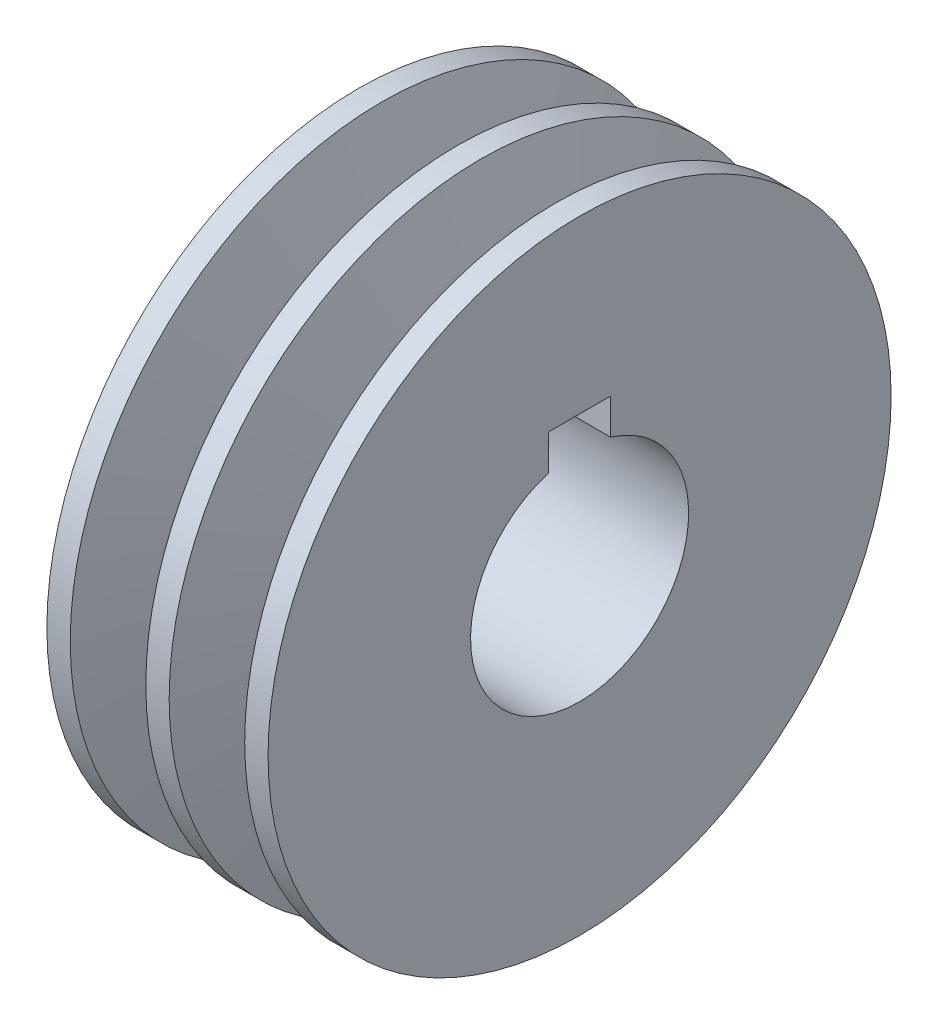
ISO-10303-21;
HEADER;
FILE_DESCRIPTION(('STEP AP214'),'2;1');
FILE_NAME('part.step','',(''),(''),'','','');
FILE_SCHEMA(('AUTOMOTIVE_DESIGN { 1 0 10303 214 1 1 1 1 }'));
ENDSEC;
DATA;
#1=APPLICATION_CONTEXT('core data for automotive mechanical design processes');
#2=APPLICATION_PROTOCOL_DEFINITION('international standard','automotive_design',2000,#1);
#3=PRODUCT_CONTEXT('',#1,'mechanical');
#4=PRODUCT('Part','Part','',(#3));
#5=PRODUCT_RELATED_PRODUCT_CATEGORY('part','',(#4));
#6=PRODUCT_DEFINITION_FORMATION('','',#4);
#7=PRODUCT_DEFINITION_CONTEXT('part definition',#1,'design');
#8=PRODUCT_DEFINITION('design','',#6,#7);
#9=PRODUCT_DEFINITION_SHAPE('','',#8);
#10=(LENGTH_UNIT() NAMED_UNIT(*) SI_UNIT(.MILLI.,.METRE.));
#11=(NAMED_UNIT(*) PLANE_ANGLE_UNIT() SI_UNIT($,.RADIAN.));
#12=(NAMED_UNIT(*) SI_UNIT($,.STERADIAN.) SOLID_ANGLE_UNIT());
#13=UNCERTAINTY_MEASURE_WITH_UNIT(LENGTH_MEASURE(1.E-05),#10,'distance_accuracy_value','');
#14=(GEOMETRIC_REPRESENTATION_CONTEXT(3) GLOBAL_UNCERTAINTY_ASSIGNED_CONTEXT((#13)) GLOBAL_UNIT_ASSIGNED_CONTEXT((#10,
#11,#12)) REPRESENTATION_CONTEXT('',''));
#15=CARTESIAN_POINT('',(0.,0.,0.));
#16=DIRECTION('',(0.,0.,1.));
#17=DIRECTION('',(1.,0.,0.));
#18=AXIS2_PLACEMENT_3D('',#15,#16,#17);
#19=CARTESIAN_POINT('',(0.,0.,0.));
#20=DIRECTION('',(1.,0.,0.));
#21=DIRECTION('',(0.,0.,-1.));
#22=AXIS2_PLACEMENT_3D('',#19,#20,#21);
#23=PLANE('',#22);
#24=DIRECTION('',(0.,1.,0.));
#25=VECTOR('',#24,1.);
#26=CARTESIAN_POINT('',(0.,0.,4.));
#27=LINE('',#26,#25);
#28=CARTESIAN_POINT('',(0.,13.4164078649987,4.));
#29=VERTEX_POINT('',#28);
#30=CARTESIAN_POINT('',(0.,18.,4.));
#31=VERTEX_POINT('',#30);
#32=EDGE_CURVE('E79',#29,#31,#27,.T.);
#33=ORIENTED_EDGE('',*,*,#32,.F.);
#34=CARTESIAN_POINT('',(0.,0.,0.));
#35=DIRECTION('',(1.,0.,0.));
#36=DIRECTION('',(0.,0.,-1.));
#37=AXIS2_PLACEMENT_3D('',#34,#35,#36);
#38=CIRCLE('',#37,14.);
#39=CARTESIAN_POINT('',(0.,13.4164078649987,-4.));
#40=VERTEX_POINT('',#39);
#41=EDGE_CURVE('E76',#29,#40,#38,.T.);
#42=ORIENTED_EDGE('',*,*,#41,.T.);
#43=DIRECTION('',(0.,1.,0.));
#44=VECTOR('',#43,1.);
#45=CARTESIAN_POINT('',(0.,0.,-4.));
#46=LINE('',#45,#44);
#47=CARTESIAN_POINT('',(0.,18.,-4.));
#48=VERTEX_POINT('',#47);
#49=EDGE_CURVE('E82',#40,#48,#46,.T.);
#50=ORIENTED_EDGE('',*,*,#49,.T.);
#51=DIRECTION('',(0.,0.,-1.));
#52=VECTOR('',#51,1.);
#53=CARTESIAN_POINT('',(0.,18.,0.));
#54=LINE('',#53,#52);
#55=EDGE_CURVE('E86',#31,#48,#54,.T.);
#56=ORIENTED_EDGE('',*,*,#55,.F.);
#57=EDGE_LOOP('',(#33,#42,#50,#56));
#58=FACE_BOUND('',#57,.T.);
#59=CARTESIAN_POINT('',(0.,0.,0.));
#60=DIRECTION('',(-1.,0.,0.));
#61=DIRECTION('',(0.,0.,1.));
#62=AXIS2_PLACEMENT_3D('',#59,#60,#61);
#63=CIRCLE('',#62,40.);
#64=CARTESIAN_POINT('',(0.,0.,40.));
#65=VERTEX_POINT('',#64);
#66=EDGE_CURVE('E11',#65,#65,#63,.T.);
#67=ORIENTED_EDGE('',*,*,#66,.T.);
#68=EDGE_LOOP('',(#67));
#69=FACE_BOUND('',#68,.T.);
#70=ADVANCED_FACE('F34',(#58,#69),#23,.F.);
#71=CARTESIAN_POINT('',(0.,0.,0.));
#72=DIRECTION('',(-1.,0.,0.));
#73=DIRECTION('',(0.,0.,1.));
#74=AXIS2_PLACEMENT_3D('',#71,#72,#73);
#75=CYLINDRICAL_SURFACE('',#74,40.);
#76=ORIENTED_EDGE('',*,*,#66,.F.);
#77=EDGE_LOOP('',(#76));
#78=FACE_BOUND('',#77,.T.);
#79=CARTESIAN_POINT('',(3.,0.,0.));
#80=DIRECTION('',(-1.,0.,0.));
#81=DIRECTION('',(0.,0.,1.));
#82=AXIS2_PLACEMENT_3D('',#79,#80,#81);
#83=CIRCLE('',#82,40.);
#84=CARTESIAN_POINT('',(3.,0.,40.));
#85=VERTEX_POINT('',#84);
#86=EDGE_CURVE('E41',#85,#85,#83,.T.);
#87=ORIENTED_EDGE('',*,*,#86,.T.);
#88=EDGE_LOOP('',(#87));
#89=FACE_BOUND('',#88,.T.);
#90=ADVANCED_FACE('F133',(#78,#89),#75,.T.);
#91=CARTESIAN_POINT('',(6.11660003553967,0.,0.));
#92=DIRECTION('',(-1.,0.,0.));
#93=DIRECTION('',(0.,0.,1.));
#94=AXIS2_PLACEMENT_3D('',#91,#92,#93);
#95=CONICAL_SURFACE('',#94,27.5,1.3264502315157);
#96=ORIENTED_EDGE('',*,*,#86,.F.);
#97=EDGE_LOOP('',(#96));
#98=FACE_BOUND('',#97,.T.);
#99=CARTESIAN_POINT('',(6.11660003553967,0.,0.));
#100=DIRECTION('',(-1.,0.,0.));
#101=DIRECTION('',(0.,0.,1.));
#102=AXIS2_PLACEMENT_3D('',#99,#100,#101);
#103=CIRCLE('',#102,27.5);
#104=CARTESIAN_POINT('',(6.11660003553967,0.,27.5));
#105=VERTEX_POINT('',#104);
#106=EDGE_CURVE('E128',#105,#105,#103,.T.);
#107=ORIENTED_EDGE('',*,*,#106,.T.);
#108=EDGE_LOOP('',(#107));
#109=FACE_BOUND('',#108,.T.);
#110=ADVANCED_FACE('F135',(#98,#109),#95,.T.);
#111=CARTESIAN_POINT('',(0.,0.,0.));
#112=DIRECTION('',(-1.,0.,0.));
#113=DIRECTION('',(0.,0.,1.));
#114=AXIS2_PLACEMENT_3D('',#111,#112,#113);
#115=CYLINDRICAL_SURFACE('',#114,27.5);
#116=ORIENTED_EDGE('',*,*,#106,.F.);
#117=EDGE_LOOP('',(#116));
#118=FACE_BOUND('',#117,.T.);
#119=CARTESIAN_POINT('',(9.58339996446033,0.,0.));
#120=DIRECTION('',(-1.,0.,0.));
#121=DIRECTION('',(0.,0.,1.));
#122=AXIS2_PLACEMENT_3D('',#119,#120,#121);
#123=CIRCLE('',#122,27.5);
#124=CARTESIAN_POINT('',(9.58339996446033,0.,27.5));
#125=VERTEX_POINT('',#124);
#126=EDGE_CURVE('E125',#125,#125,#123,.T.);
#127=ORIENTED_EDGE('',*,*,#126,.T.);
#128=EDGE_LOOP('',(#127));
#129=FACE_BOUND('',#128,.T.);
#130=ADVANCED_FACE('F138',(#118,#129),#115,.T.);
#131=CARTESIAN_POINT('',(12.7,0.,0.));
#132=DIRECTION('',(1.,0.,0.));
#133=DIRECTION('',(0.,0.,-1.));
#134=AXIS2_PLACEMENT_3D('',#131,#132,#133);
#135=CONICAL_SURFACE('',#134,40.,1.3264502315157);
#136=ORIENTED_EDGE('',*,*,#126,.F.);
#137=EDGE_LOOP('',(#136));
#138=FACE_BOUND('',#137,.T.);
#139=CARTESIAN_POINT('',(12.7,0.,0.));
#140=DIRECTION('',(-1.,0.,0.));
#141=DIRECTION('',(0.,0.,1.));
#142=AXIS2_PLACEMENT_3D('',#139,#140,#141);
#143=CIRCLE('',#142,40.);
#144=CARTESIAN_POINT('',(12.7,0.,40.));
#145=VERTEX_POINT('',#144);
#146=EDGE_CURVE('E122',#145,#145,#143,.T.);
#147=ORIENTED_EDGE('',*,*,#146,.T.);
#148=EDGE_LOOP('',(#147));
#149=FACE_BOUND('',#148,.T.);
#150=ADVANCED_FACE('F144',(#138,#149),#135,.T.);
#151=CARTESIAN_POINT('',(0.,0.,0.));
#152=DIRECTION('',(-1.,0.,0.));
#153=DIRECTION('',(0.,0.,1.));
#154=AXIS2_PLACEMENT_3D('',#151,#152,#153);
#155=CYLINDRICAL_SURFACE('',#154,40.);
#156=ORIENTED_EDGE('',*,*,#146,.F.);
#157=EDGE_LOOP('',(#156));
#158=FACE_BOUND('',#157,.T.);
#159=CARTESIAN_POINT('',(15.7,0.,0.));
#160=DIRECTION('',(-1.,0.,0.));
#161=DIRECTION('',(0.,0.,1.));
#162=AXIS2_PLACEMENT_3D('',#159,#160,#161);
#163=CIRCLE('',#162,40.);
#164=CARTESIAN_POINT('',(15.7,0.,40.));
#165=VERTEX_POINT('',#164);
#166=EDGE_CURVE('E119',#165,#165,#163,.T.);
#167=ORIENTED_EDGE('',*,*,#166,.T.);
#168=EDGE_LOOP('',(#167));
#169=FACE_BOUND('',#168,.T.);
#170=ADVANCED_FACE('F150',(#158,#169),#155,.T.);
#171=CARTESIAN_POINT('',(18.8166000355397,0.,0.));
#172=DIRECTION('',(-1.,0.,0.));
#173=DIRECTION('',(0.,0.,1.));
#174=AXIS2_PLACEMENT_3D('',#171,#172,#173);
#175=CONICAL_SURFACE('',#174,27.5,1.3264502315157);
#176=ORIENTED_EDGE('',*,*,#166,.F.);
#177=EDGE_LOOP('',(#176));
#178=FACE_BOUND('',#177,.T.);
#179=CARTESIAN_POINT('',(18.8166000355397,0.,0.));
#180=DIRECTION('',(-1.,0.,0.));
#181=DIRECTION('',(0.,0.,1.));
#182=AXIS2_PLACEMENT_3D('',#179,#180,#181);
#183=CIRCLE('',#182,27.5);
#184=CARTESIAN_POINT('',(18.8166000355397,0.,27.5));
#185=VERTEX_POINT('',#184);
#186=EDGE_CURVE('E116',#185,#185,#183,.T.);
#187=ORIENTED_EDGE('',*,*,#186,.T.);
#188=EDGE_LOOP('',(#187));
#189=FACE_BOUND('',#188,.T.);
#190=ADVANCED_FACE('F156',(#178,#189),#175,.T.);
#191=CARTESIAN_POINT('',(0.,0.,0.));
#192=DIRECTION('',(-1.,0.,0.));
#193=DIRECTION('',(0.,0.,1.));
#194=AXIS2_PLACEMENT_3D('',#191,#192,#193);
#195=CYLINDRICAL_SURFACE('',#194,27.5);
#196=ORIENTED_EDGE('',*,*,#186,.F.);
#197=EDGE_LOOP('',(#196));
#198=FACE_BOUND('',#197,.T.);
#199=CARTESIAN_POINT('',(22.2833999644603,0.,0.));
#200=DIRECTION('',(-1.,0.,0.));
#201=DIRECTION('',(0.,0.,1.));
#202=AXIS2_PLACEMENT_3D('',#199,#200,#201);
#203=CIRCLE('',#202,27.5);
#204=CARTESIAN_POINT('',(22.2833999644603,0.,27.5));
#205=VERTEX_POINT('',#204);
#206=EDGE_CURVE('E113',#205,#205,#203,.T.);
#207=ORIENTED_EDGE('',*,*,#206,.T.);
#208=EDGE_LOOP('',(#207));
#209=FACE_BOUND('',#208,.T.);
#210=ADVANCED_FACE('F162',(#198,#209),#195,.T.);
#211=CARTESIAN_POINT('',(25.4,0.,0.));
#212=DIRECTION('',(1.,0.,0.));
#213=DIRECTION('',(0.,0.,-1.));
#214=AXIS2_PLACEMENT_3D('',#211,#212,#213);
#215=CONICAL_SURFACE('',#214,40.,1.3264502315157);
#216=ORIENTED_EDGE('',*,*,#206,.F.);
#217=EDGE_LOOP('',(#216));
#218=FACE_BOUND('',#217,.T.);
#219=CARTESIAN_POINT('',(25.4,0.,0.));
#220=DIRECTION('',(-1.,0.,0.));
#221=DIRECTION('',(0.,0.,1.));
#222=AXIS2_PLACEMENT_3D('',#219,#220,#221);
#223=CIRCLE('',#222,40.);
#224=CARTESIAN_POINT('',(25.4,0.,40.));
#225=VERTEX_POINT('',#224);
#226=EDGE_CURVE('E110',#225,#225,#223,.T.);
#227=ORIENTED_EDGE('',*,*,#226,.T.);
#228=EDGE_LOOP('',(#227));
#229=FACE_BOUND('',#228,.T.);
#230=ADVANCED_FACE('F168',(#218,#229),#215,.T.);
#231=CARTESIAN_POINT('',(0.,0.,0.));
#232=DIRECTION('',(-1.,0.,0.));
#233=DIRECTION('',(0.,0.,1.));
#234=AXIS2_PLACEMENT_3D('',#231,#232,#233);
#235=CYLINDRICAL_SURFACE('',#234,40.);
#236=ORIENTED_EDGE('',*,*,#226,.F.);
#237=EDGE_LOOP('',(#236));
#238=FACE_BOUND('',#237,.T.);
#239=CARTESIAN_POINT('',(28.4,0.,0.));
#240=DIRECTION('',(-1.,0.,0.));
#241=DIRECTION('',(0.,0.,1.));
#242=AXIS2_PLACEMENT_3D('',#239,#240,#241);
#243=CIRCLE('',#242,40.);
#244=CARTESIAN_POINT('',(28.4,0.,40.));
#245=VERTEX_POINT('',#244);
#246=EDGE_CURVE('E104',#245,#245,#243,.T.);
#247=ORIENTED_EDGE('',*,*,#246,.T.);
#248=EDGE_LOOP('',(#247));
#249=FACE_BOUND('',#248,.T.);
#250=ADVANCED_FACE('F174',(#238,#249),#235,.T.);
#251=CARTESIAN_POINT('',(28.4,40.,0.));
#252=DIRECTION('',(-1.,0.,0.));
#253=DIRECTION('',(0.,0.,1.));
#254=AXIS2_PLACEMENT_3D('',#251,#252,#253);
#255=PLANE('',#254);
#256=DIRECTION('',(0.,1.,0.));
#257=VECTOR('',#256,1.);
#258=CARTESIAN_POINT('',(28.4,0.,-4.));
#259=LINE('',#258,#257);
#260=CARTESIAN_POINT('',(28.4,13.4164078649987,-4.));
#261=VERTEX_POINT('',#260);
#262=CARTESIAN_POINT('',(28.4,18.,-4.));
#263=VERTEX_POINT('',#262);
#264=EDGE_CURVE('E98',#261,#263,#259,.T.);
#265=ORIENTED_EDGE('',*,*,#264,.F.);
#266=CARTESIAN_POINT('',(28.4,0.,0.));
#267=DIRECTION('',(1.,0.,0.));
#268=DIRECTION('',(0.,0.,-1.));
#269=AXIS2_PLACEMENT_3D('',#266,#267,#268);
#270=CIRCLE('',#269,14.);
#271=CARTESIAN_POINT('',(28.4,13.4164078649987,4.));
#272=VERTEX_POINT('',#271);
#273=EDGE_CURVE('E56',#272,#261,#270,.T.);
#274=ORIENTED_EDGE('',*,*,#273,.F.);
#275=DIRECTION('',(0.,1.,0.));
#276=VECTOR('',#275,1.);
#277=CARTESIAN_POINT('',(28.4,0.,4.));
#278=LINE('',#277,#276);
#279=CARTESIAN_POINT('',(28.4,18.,4.));
#280=VERTEX_POINT('',#279);
#281=EDGE_CURVE('E89',#272,#280,#278,.T.);
#282=ORIENTED_EDGE('',*,*,#281,.T.);
#283=DIRECTION('',(0.,0.,-1.));
#284=VECTOR('',#283,1.);
#285=CARTESIAN_POINT('',(28.4,18.,0.));
#286=LINE('',#285,#284);
#287=EDGE_CURVE('E92',#280,#263,#286,.T.);
#288=ORIENTED_EDGE('',*,*,#287,.T.);
#289=EDGE_LOOP('',(#265,#274,#282,#288));
#290=FACE_BOUND('',#289,.T.);
#291=ORIENTED_EDGE('',*,*,#246,.F.);
#292=EDGE_LOOP('',(#291));
#293=FACE_BOUND('',#292,.T.);
#294=ADVANCED_FACE('F180',(#290,#293),#255,.F.);
#295=CARTESIAN_POINT('',(0.,0.,0.));
#296=DIRECTION('',(1.,0.,0.));
#297=DIRECTION('',(0.,0.,-1.));
#298=AXIS2_PLACEMENT_3D('',#295,#296,#297);
#299=CYLINDRICAL_SURFACE('',#298,14.);
#300=ORIENTED_EDGE('',*,*,#273,.T.);
#301=DIRECTION('',(1.,0.,0.));
#302=VECTOR('',#301,1.);
#303=CARTESIAN_POINT('',(0.,13.4164078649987,-4.));
#304=LINE('',#303,#302);
#305=EDGE_CURVE('E73',#40,#261,#304,.T.);
#306=ORIENTED_EDGE('',*,*,#305,.F.);
#307=ORIENTED_EDGE('',*,*,#41,.F.);
#308=DIRECTION('',(1.,0.,0.));
#309=VECTOR('',#308,1.);
#310=CARTESIAN_POINT('',(0.,13.4164078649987,4.));
#311=LINE('',#310,#309);
#312=EDGE_CURVE('E102',#29,#272,#311,.T.);
#313=ORIENTED_EDGE('',*,*,#312,.T.);
#314=EDGE_LOOP('',(#300,#306,#307,#313));
#315=FACE_BOUND('',#314,.T.);
#316=ADVANCED_FACE('F74',(#315),#299,.F.);
#317=CARTESIAN_POINT('',(0.,0.,4.));
#318=DIRECTION('',(0.,0.,-1.));
#319=DIRECTION('',(-1.,0.,0.));
#320=AXIS2_PLACEMENT_3D('',#317,#318,#319);
#321=PLANE('',#320);
#322=ORIENTED_EDGE('',*,*,#281,.F.);
#323=ORIENTED_EDGE('',*,*,#312,.F.);
#324=ORIENTED_EDGE('',*,*,#32,.T.);
#325=DIRECTION('',(1.,0.,0.));
#326=VECTOR('',#325,1.);
#327=CARTESIAN_POINT('',(0.,18.,4.));
#328=LINE('',#327,#326);
#329=EDGE_CURVE('E105',#31,#280,#328,.T.);
#330=ORIENTED_EDGE('',*,*,#329,.T.);
#331=EDGE_LOOP('',(#322,#323,#324,#330));
#332=FACE_BOUND('',#331,.T.);
#333=ADVANCED_FACE('F190',(#332),#321,.T.);
#334=CARTESIAN_POINT('',(0.,18.,0.));
#335=DIRECTION('',(0.,-1.,0.));
#336=DIRECTION('',(0.,0.,-1.));
#337=AXIS2_PLACEMENT_3D('',#334,#335,#336);
#338=PLANE('',#337);
#339=ORIENTED_EDGE('',*,*,#287,.F.);
#340=ORIENTED_EDGE('',*,*,#329,.F.);
#341=ORIENTED_EDGE('',*,*,#55,.T.);
#342=DIRECTION('',(1.,0.,0.));
#343=VECTOR('',#342,1.);
#344=CARTESIAN_POINT('',(0.,18.,-4.));
#345=LINE('',#344,#343);
#346=EDGE_CURVE('E48',#48,#263,#345,.T.);
#347=ORIENTED_EDGE('',*,*,#346,.T.);
#348=EDGE_LOOP('',(#339,#340,#341,#347));
#349=FACE_BOUND('',#348,.T.);
#350=ADVANCED_FACE('F255',(#349),#338,.T.);
#351=CARTESIAN_POINT('',(0.,0.,-4.));
#352=DIRECTION('',(0.,0.,-1.));
#353=DIRECTION('',(-1.,0.,0.));
#354=AXIS2_PLACEMENT_3D('',#351,#352,#353);
#355=PLANE('',#354);
#356=ORIENTED_EDGE('',*,*,#264,.T.);
#357=ORIENTED_EDGE('',*,*,#346,.F.);
#358=ORIENTED_EDGE('',*,*,#49,.F.);
#359=ORIENTED_EDGE('',*,*,#305,.T.);
#360=EDGE_LOOP('',(#356,#357,#358,#359));
#361=FACE_BOUND('',#360,.T.);
#362=ADVANCED_FACE('F83',(#361),#355,.F.);
#363=CLOSED_SHELL('',(#70,#90,#110,#130,#150,#170,#190,#210,#230,#250,#294,#316,#333,#350,#362));
#364=MANIFOLD_SOLID_BREP('B2',#363);
#365=ADVANCED_BREP_SHAPE_REPRESENTATION('',(#18,#364),#14);
#366=SHAPE_DEFINITION_REPRESENTATION(#9,#365);
ENDSEC;
END-ISO-10303-21;
